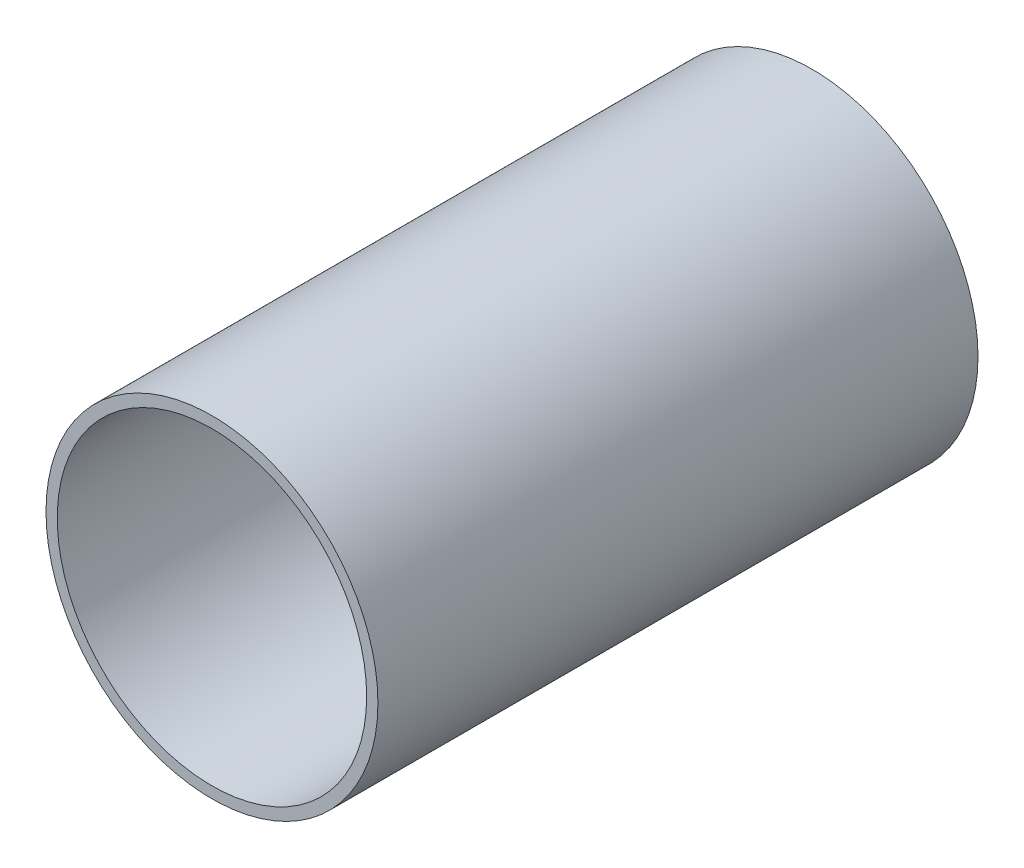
ISO-10303-21;
HEADER;
FILE_DESCRIPTION(('STEP AP214'),'2;1');
FILE_NAME('part.step','',(''),(''),'','','');
FILE_SCHEMA(('AUTOMOTIVE_DESIGN { 1 0 10303 214 1 1 1 1 }'));
ENDSEC;
DATA;
#1=APPLICATION_CONTEXT('core data for automotive mechanical design processes');
#2=APPLICATION_PROTOCOL_DEFINITION('international standard','automotive_design',2000,#1);
#3=PRODUCT_CONTEXT('',#1,'mechanical');
#4=PRODUCT('Part','Part','',(#3));
#5=PRODUCT_RELATED_PRODUCT_CATEGORY('part','',(#4));
#6=PRODUCT_DEFINITION_FORMATION('','',#4);
#7=PRODUCT_DEFINITION_CONTEXT('part definition',#1,'design');
#8=PRODUCT_DEFINITION('design','',#6,#7);
#9=PRODUCT_DEFINITION_SHAPE('','',#8);
#10=(LENGTH_UNIT() NAMED_UNIT(*) SI_UNIT(.MILLI.,.METRE.));
#11=(NAMED_UNIT(*) PLANE_ANGLE_UNIT() SI_UNIT($,.RADIAN.));
#12=(NAMED_UNIT(*) SI_UNIT($,.STERADIAN.) SOLID_ANGLE_UNIT());
#13=UNCERTAINTY_MEASURE_WITH_UNIT(LENGTH_MEASURE(1.E-05),#10,'distance_accuracy_value','');
#14=(GEOMETRIC_REPRESENTATION_CONTEXT(3) GLOBAL_UNCERTAINTY_ASSIGNED_CONTEXT((#13)) GLOBAL_UNIT_ASSIGNED_CONTEXT((#10,
#11,#12)) REPRESENTATION_CONTEXT('',''));
#15=CARTESIAN_POINT('',(0.,0.,0.));
#16=DIRECTION('',(0.,0.,1.));
#17=DIRECTION('',(1.,0.,0.));
#18=AXIS2_PLACEMENT_3D('',#15,#16,#17);
#19=CARTESIAN_POINT('',(0.,0.,-203.2));
#20=DIRECTION('',(0.,0.,1.));
#21=DIRECTION('',(1.,0.,0.));
#22=AXIS2_PLACEMENT_3D('',#19,#20,#21);
#23=CYLINDRICAL_SURFACE('',#22,56.1975);
#24=CARTESIAN_POINT('',(0.,0.,-203.2));
#25=DIRECTION('',(0.,0.,1.));
#26=DIRECTION('',(1.,0.,0.));
#27=AXIS2_PLACEMENT_3D('',#24,#25,#26);
#28=CIRCLE('',#27,56.1975);
#29=CARTESIAN_POINT('',(56.1975,0.,-203.2));
#30=VERTEX_POINT('',#29);
#31=EDGE_CURVE('E10',#30,#30,#28,.T.);
#32=ORIENTED_EDGE('',*,*,#31,.T.);
#33=EDGE_LOOP('',(#32));
#34=FACE_BOUND('',#33,.T.);
#35=CARTESIAN_POINT('',(0.,0.,0.));
#36=DIRECTION('',(0.,0.,1.));
#37=DIRECTION('',(1.,0.,0.));
#38=AXIS2_PLACEMENT_3D('',#35,#36,#37);
#39=CIRCLE('',#38,56.1975);
#40=CARTESIAN_POINT('',(56.1975,0.,0.));
#41=VERTEX_POINT('',#40);
#42=EDGE_CURVE('E38',#41,#41,#39,.T.);
#43=ORIENTED_EDGE('',*,*,#42,.F.);
#44=EDGE_LOOP('',(#43));
#45=FACE_BOUND('',#44,.T.);
#46=ADVANCED_FACE('F35',(#34,#45),#23,.T.);
#47=CARTESIAN_POINT('',(0.,0.,-203.2));
#48=DIRECTION('',(0.,0.,1.));
#49=DIRECTION('',(1.,0.,0.));
#50=AXIS2_PLACEMENT_3D('',#47,#48,#49);
#51=PLANE('',#50);
#52=CARTESIAN_POINT('',(0.,0.,-203.2));
#53=DIRECTION('',(0.,0.,1.));
#54=DIRECTION('',(1.,0.,0.));
#55=AXIS2_PLACEMENT_3D('',#52,#53,#54);
#56=CIRCLE('',#55,52.3875);
#57=CARTESIAN_POINT('',(52.3875,0.,-203.2));
#58=VERTEX_POINT('',#57);
#59=EDGE_CURVE('E45',#58,#58,#56,.T.);
#60=ORIENTED_EDGE('',*,*,#59,.T.);
#61=EDGE_LOOP('',(#60));
#62=FACE_BOUND('',#61,.T.);
#63=ORIENTED_EDGE('',*,*,#31,.F.);
#64=EDGE_LOOP('',(#63));
#65=FACE_BOUND('',#64,.T.);
#66=ADVANCED_FACE('F53',(#62,#65),#51,.F.);
#67=CARTESIAN_POINT('',(0.,0.,0.));
#68=DIRECTION('',(0.,0.,1.));
#69=DIRECTION('',(1.,0.,0.));
#70=AXIS2_PLACEMENT_3D('',#67,#68,#69);
#71=PLANE('',#70);
#72=CARTESIAN_POINT('',(0.,0.,0.));
#73=DIRECTION('',(0.,0.,1.));
#74=DIRECTION('',(1.,0.,0.));
#75=AXIS2_PLACEMENT_3D('',#72,#73,#74);
#76=CIRCLE('',#75,52.3875);
#77=CARTESIAN_POINT('',(52.3875,0.,0.));
#78=VERTEX_POINT('',#77);
#79=EDGE_CURVE('E47',#78,#78,#76,.T.);
#80=ORIENTED_EDGE('',*,*,#79,.F.);
#81=EDGE_LOOP('',(#80));
#82=FACE_BOUND('',#81,.T.);
#83=ORIENTED_EDGE('',*,*,#42,.T.);
#84=EDGE_LOOP('',(#83));
#85=FACE_BOUND('',#84,.T.);
#86=ADVANCED_FACE('F59',(#82,#85),#71,.T.);
#87=CARTESIAN_POINT('',(0.,0.,-203.2));
#88=DIRECTION('',(0.,0.,1.));
#89=DIRECTION('',(1.,0.,0.));
#90=AXIS2_PLACEMENT_3D('',#87,#88,#89);
#91=CYLINDRICAL_SURFACE('',#90,52.3875);
#92=ORIENTED_EDGE('',*,*,#59,.F.);
#93=EDGE_LOOP('',(#92));
#94=FACE_BOUND('',#93,.T.);
#95=ORIENTED_EDGE('',*,*,#79,.T.);
#96=EDGE_LOOP('',(#95));
#97=FACE_BOUND('',#96,.T.);
#98=ADVANCED_FACE('F56',(#94,#97),#91,.F.);
#99=CLOSED_SHELL('',(#46,#66,#86,#98));
#100=MANIFOLD_SOLID_BREP('B2',#99);
#101=ADVANCED_BREP_SHAPE_REPRESENTATION('',(#18,#100),#14);
#102=SHAPE_DEFINITION_REPRESENTATION(#9,#101);
ENDSEC;
END-ISO-10303-21;
